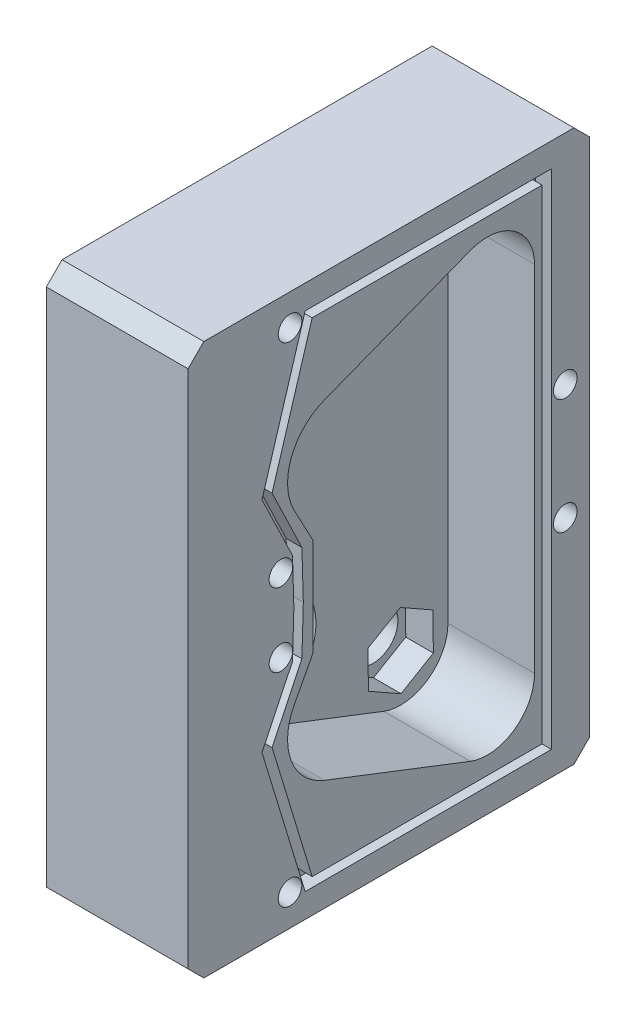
from build123d import *

# Parameters (mm, degrees)
SKETCH1_W           = 18
SKETCH1_H           = 70
BOSS_EXTRUDE1_DEPTH = 51
SKETCH2_R           = 7.3
SKETCH2_R_2         = 3.15
CUT_EXTRUDE1_DEPTH  = 89.301296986
CUT_EXTRUDE2_START  = -3.5
SKETCH2_3_R         = 3.15
CUT_EXTRUDE2_DEPTH  = 85.801296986
CUT_EXTRUDE7_START  = -7
SKETCH2_6_R         = 6
CUT_EXTRUDE7_DEPTH  = 82.301296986
CHAMFER1_SIZE       = 2
SKETCH5_R           = 1.5
CUT_EXTRUDE5_DEPTH  = 89.301296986
CUT_EXTRUDE8_DEPTH  = 2
SKETCH7_R           = 3
CUT_EXTRUDE9_DEPTH  = 12
CUT_EXTRUDE10_START = -11
CUT_EXTRUDE10_DEPTH = 11
SKETCH10_R          = 2.125
CUT_EXTRUDE11_DEPTH = 6


with BuildPart() as part:
    # Sketch1 → Boss-Extrude1 (new body)
    with BuildSketch(Plane.XY):
        with Locations((-129.319608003, 34.800566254)):
            Rectangle(SKETCH1_W, SKETCH1_H)
    extrude(amount=-BOSS_EXTRUDE1_DEPTH)

    # Sketch2 → Cut-Extrude1 (cut, through all)
    with BuildSketch(Plane.ZY.offset(138.319608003)):
        with Locations((-19.935472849, 20.697627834)):
            Circle(SKETCH2_R)
        with Locations((-19.935472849, 48.903504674)):
            Circle(SKETCH2_R)
        with Locations((-38, 57.293429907)):
            Circle(SKETCH2_R_2)
        with Locations((-38, 12.307702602)):
            Circle(SKETCH2_R_2)
    extrude(amount=-CUT_EXTRUDE1_DEPTH, mode=Mode.SUBTRACT)

    # Sketch2_3 → Cut-Extrude2 (cut, through all)
    # profile 1 of 2: a face of its own
    with BuildSketch(Plane.ZY.offset(138.319608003).offset(CUT_EXTRUDE2_START)):
        Polygon((-33.897955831, 9.886807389), (-33.852421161, 14.649729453), (-37.95446533, 17.070624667), (-42.102044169, 14.728597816), (-42.147578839, 9.965675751), (-38.04553467, 7.544780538), align=None)
        with Locations((-38, 12.307702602)):
            Circle(SKETCH2_3_R, mode=Mode.SUBTRACT)
    # profile 2 of 2: a face of its own
    with BuildSketch(Plane.ZY.offset(138.319608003).offset(CUT_EXTRUDE2_START)):
        Polygon((-42.07549811, 59.758752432), (-42.172780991, 54.996606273), (-38.097282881, 52.531283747), (-33.92450189, 54.828107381), (-33.827219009, 59.59025354), (-37.902717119, 62.055576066), align=None)
        with Locations((-38, 57.293429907)):
            Circle(SKETCH2_3_R, mode=Mode.SUBTRACT)
    extrude(amount=-CUT_EXTRUDE2_DEPTH, mode=Mode.SUBTRACT)

    # Sketch2_6 → Cut-Extrude7 (cut, through all)
    # profile 1 of 2: a face of its own
    with BuildSketch(Plane.ZY.offset(138.319608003).offset(CUT_EXTRUDE7_START)):
        with Locations((-38, 57.293429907)):
            Circle(SKETCH2_6_R)
        Polygon((-42.172780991, 54.996606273), (-38.097282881, 52.531283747), (-33.92450189, 54.828107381), (-33.827219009, 59.59025354), (-37.902717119, 62.055576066), (-42.07549811, 59.758752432), align=None, mode=Mode.SUBTRACT)
    # profile 2 of 2: a face of its own
    with BuildSketch(Plane.ZY.offset(138.319608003).offset(CUT_EXTRUDE7_START)):
        with Locations((-38, 12.307702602)):
            Circle(SKETCH2_6_R)
        Polygon((-33.852421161, 14.649729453), (-37.95446533, 17.070624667), (-42.102044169, 14.728597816), (-42.147578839, 9.965675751), (-38.04553467, 7.544780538), (-33.897955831, 9.886807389), align=None, mode=Mode.SUBTRACT)
    extrude(amount=-CUT_EXTRUDE7_DEPTH, mode=Mode.SUBTRACT)

    # Chamfer1
    chamfer1_edges = [part.edges().sort_by_distance(p)[0] for p in [
        (-129.319608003, 69.800566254, -51),
        (-129.319608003, -0.199433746, -51),
        (-129.319608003, -0.199433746, 0),
        (-129.319608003, 69.800566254, 0),
    ]]
    chamfer(chamfer1_edges, length=CHAMFER1_SIZE)

    # Sketch5 → Cut-Extrude5 (cut, through all)
    with BuildSketch(Plane.ZY.offset(138.319608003)):
        with Locations((-47.9, 42.125077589)):
            Circle(SKETCH5_R)
        with Locations((-47.9, 27.47605492)):
            Circle(SKETCH5_R)
        with Locations((-12.947792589, 65.839683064)):
            Circle(SKETCH5_R)
        with Locations((-12.947792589, 3.761449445)):
            Circle(SKETCH5_R)
        with Locations((-11.795402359, 30.147605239)):
            Circle(SKETCH5_R)
        with Locations((-11.795402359, 39.45352727)):
            Circle(SKETCH5_R)
    extrude(amount=-CUT_EXTRUDE5_DEPTH, mode=Mode.SUBTRACT)

    # Sketch6 → Cut-Extrude8 (cut)
    with BuildSketch(Plane(origin=(-120.319608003, 0, 0), x_dir=(0, 0, -1), z_dir=(1, 0, 0))):
        Polygon((13.435631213, 34.800566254), (13.262504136, 28.969278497), (9.384714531, 20.90793024), (14.869712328, 2.870205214), (46.149078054, 2.870205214), (46.149078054, 66.730927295), (14.869712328, 66.730927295), (9.384714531, 48.693202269), (13.262504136, 40.631854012), align=None)
        Polygon((10.668932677, 20.809391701), (15.759064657, 4.070205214), (44.949078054, 4.070205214), (44.949078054, 65.530927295), (15.759064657, 65.530927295), (10.668932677, 48.791740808), (14.454409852, 40.922296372), (14.636159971, 34.800566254), (14.454409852, 28.678836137), align=None, mode=Mode.SUBTRACT)
    extrude(amount=-CUT_EXTRUDE8_DEPTH, mode=Mode.SUBTRACT)

    # Sketch7 → Cut-Extrude9 (cut)
    with BuildSketch(Plane.ZY.offset(138.319608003)):
        with Locations((-12.947792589, 65.839683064)):
            Circle(SKETCH7_R)
        with Locations((-11.795402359, 39.45352727)):
            Circle(SKETCH7_R)
        with Locations((-11.795402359, 30.147605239)):
            Circle(SKETCH7_R)
        with Locations((-12.947792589, 3.761449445)):
            Circle(SKETCH7_R)
        with Locations((-38, 12.307702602)):
            Circle(SKETCH7_R)
        with Locations((-38, 57.293429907)):
            Circle(SKETCH7_R)
        with Locations((-47.9, 42.125077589)):
            Circle(SKETCH7_R)
        with Locations((-47.9, 27.47605492)):
            Circle(SKETCH7_R)
    extrude(amount=-CUT_EXTRUDE9_DEPTH, mode=Mode.SUBTRACT)

    # Sketch8 → Cut-Extrude10 (cut)
    with BuildSketch(Plane(origin=(-120.319608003, 0, 0), x_dir=(0, 0, -1), z_dir=(1, 0, 0)).offset(CUT_EXTRUDE10_START)):
        with BuildLine():
            Line((15.881499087, 28.636466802), (13.485598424, 24.116563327))
            ThreePointArc((13.485598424, 24.116563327), (21.696994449, 27.781909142), (27.235472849, 20.697627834))
            Line((27.235472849, 20.697627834), (27.235472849, 34.800566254))
            Line((27.235472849, 34.800566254), (15.881499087, 34.800566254))
            Line((15.881499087, 34.800566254), (15.881499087, 28.636466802))
        make_face()
        with BuildLine():
            Line((15.881499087, 40.964665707), (15.881499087, 34.800566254))
            Line((15.881499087, 34.800566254), (27.235472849, 34.800566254))
            Line((27.235472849, 34.800566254), (27.235472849, 48.903504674))
            ThreePointArc((27.235472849, 48.903504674), (21.696994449, 41.819223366), (13.485598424, 45.484569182))
            Line((13.485598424, 45.484569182), (15.881499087, 40.964665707))
        make_face()
        with BuildLine():
            Line((27.235472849, 34.800566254), (27.235472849, 20.697627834))
            ThreePointArc((27.235472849, 20.697627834), (24.061315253, 14.675383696), (17.299192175, 13.890277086))
            Line((17.299192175, 13.890277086), (35.833193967, 6.712619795))
            ThreePointArc((35.833193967, 6.712619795), (34.608896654, 17.257492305), (44, 12.307702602))
            Line((44, 12.307702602), (44, 34.800566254))
            Line((44, 34.800566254), (27.235472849, 34.800566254))
        make_face()
        with BuildLine():
            Line((27.235472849, 48.903504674), (27.235472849, 34.800566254))
            Line((27.235472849, 34.800566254), (44, 34.800566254))
            Line((44, 34.800566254), (44, 57.293429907))
            ThreePointArc((44, 57.293429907), (34.608896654, 52.343640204), (35.833193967, 62.888512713))
            Line((35.833193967, 62.888512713), (17.299192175, 55.710855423))
            ThreePointArc((17.299192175, 55.710855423), (24.061315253, 54.925748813), (27.235472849, 48.903504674))
        make_face()
    extrude(amount=CUT_EXTRUDE10_DEPTH, mode=Mode.SUBTRACT)

    # Sketch10 → Cut-Extrude11 (cut)
    with BuildSketch(Plane.ZY.offset(138.319608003)):
        with Locations((-22.126995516, 6.471256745)):
            Circle(SKETCH10_R)
        with Locations((-5.521472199, 13.881878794)):
            Circle(SKETCH10_R)
        with Locations((-22.126995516, 63.129875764)):
            Circle(SKETCH10_R)
        with Locations((-5.521472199, 55.719253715)):
            Circle(SKETCH10_R)
    extrude(amount=-CUT_EXTRUDE11_DEPTH, mode=Mode.SUBTRACT)


solid = part.part
